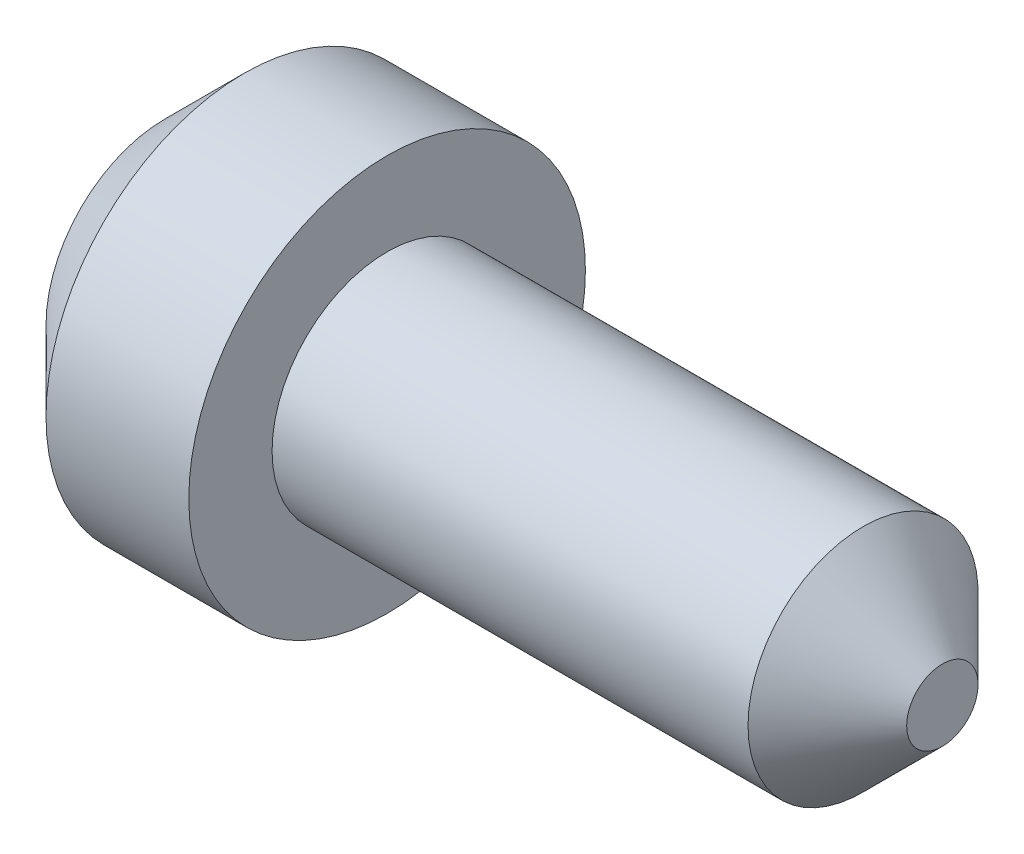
ISO-10303-21;
HEADER;
FILE_DESCRIPTION(('STEP AP214'),'2;1');
FILE_NAME('part.step','',(''),(''),'','','');
FILE_SCHEMA(('AUTOMOTIVE_DESIGN { 1 0 10303 214 1 1 1 1 }'));
ENDSEC;
DATA;
#1=APPLICATION_CONTEXT('core data for automotive mechanical design processes');
#2=APPLICATION_PROTOCOL_DEFINITION('international standard','automotive_design',2000,#1);
#3=PRODUCT_CONTEXT('',#1,'mechanical');
#4=PRODUCT('Part','Part','',(#3));
#5=PRODUCT_RELATED_PRODUCT_CATEGORY('part','',(#4));
#6=PRODUCT_DEFINITION_FORMATION('','',#4);
#7=PRODUCT_DEFINITION_CONTEXT('part definition',#1,'design');
#8=PRODUCT_DEFINITION('design','',#6,#7);
#9=PRODUCT_DEFINITION_SHAPE('','',#8);
#10=(LENGTH_UNIT() NAMED_UNIT(*) SI_UNIT(.MILLI.,.METRE.));
#11=(NAMED_UNIT(*) PLANE_ANGLE_UNIT() SI_UNIT($,.RADIAN.));
#12=(NAMED_UNIT(*) SI_UNIT($,.STERADIAN.) SOLID_ANGLE_UNIT());
#13=UNCERTAINTY_MEASURE_WITH_UNIT(LENGTH_MEASURE(1.E-05),#10,'distance_accuracy_value','');
#14=(GEOMETRIC_REPRESENTATION_CONTEXT(3) GLOBAL_UNCERTAINTY_ASSIGNED_CONTEXT((#13)) GLOBAL_UNIT_ASSIGNED_CONTEXT((#10,
#11,#12)) REPRESENTATION_CONTEXT('',''));
#15=CARTESIAN_POINT('',(0.,0.,0.));
#16=DIRECTION('',(0.,0.,1.));
#17=DIRECTION('',(1.,0.,0.));
#18=AXIS2_PLACEMENT_3D('',#15,#16,#17);
#19=CARTESIAN_POINT('',(0.,0.,0.));
#20=DIRECTION('',(1.,0.,0.));
#21=DIRECTION('',(0.,0.,-1.));
#22=AXIS2_PLACEMENT_3D('',#19,#20,#21);
#23=PLANE('',#22);
#24=CARTESIAN_POINT('',(0.,0.,0.));
#25=DIRECTION('',(1.,0.,0.));
#26=DIRECTION('',(0.,1.,0.));
#27=AXIS2_PLACEMENT_3D('',#24,#25,#26);
#28=CIRCLE('',#27,2.53999999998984);
#29=CARTESIAN_POINT('',(0.,2.53999999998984,0.));
#30=VERTEX_POINT('',#29);
#31=EDGE_CURVE('E18',#30,#30,#28,.T.);
#32=ORIENTED_EDGE('',*,*,#31,.F.);
#33=EDGE_LOOP('',(#32));
#34=FACE_BOUND('',#33,.T.);
#35=ADVANCED_FACE('F15',(#34),#23,.F.);
#36=CARTESIAN_POINT('',(1.69333333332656,0.,0.));
#37=DIRECTION('',(1.,0.,0.));
#38=DIRECTION('',(0.,1.,0.));
#39=AXIS2_PLACEMENT_3D('',#36,#37,#38);
#40=CONICAL_SURFACE('',#39,4.23333333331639,0.785398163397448);
#41=CARTESIAN_POINT('',(1.69333333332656,0.,0.));
#42=DIRECTION('',(1.,0.,0.));
#43=DIRECTION('',(0.,0.,-1.));
#44=AXIS2_PLACEMENT_3D('',#41,#42,#43);
#45=CIRCLE('',#44,4.2333333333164);
#46=CARTESIAN_POINT('',(1.69333333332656,0.,-4.2333333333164));
#47=VERTEX_POINT('',#46);
#48=EDGE_CURVE('E31',#47,#47,#45,.T.);
#49=ORIENTED_EDGE('',*,*,#48,.F.);
#50=EDGE_LOOP('',(#49));
#51=FACE_BOUND('',#50,.T.);
#52=ORIENTED_EDGE('',*,*,#31,.T.);
#53=EDGE_LOOP('',(#52));
#54=FACE_BOUND('',#53,.T.);
#55=ADVANCED_FACE('F43',(#51,#54),#40,.T.);
#56=CARTESIAN_POINT('',(16.5946666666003,0.,0.));
#57=DIRECTION('',(-1.,0.,0.));
#58=DIRECTION('',(0.,0.,1.));
#59=AXIS2_PLACEMENT_3D('',#56,#57,#58);
#60=PLANE('',#59);
#61=CARTESIAN_POINT('',(16.5946666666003,0.,0.));
#62=DIRECTION('',(-1.,0.,0.));
#63=DIRECTION('',(0.,0.,1.));
#64=AXIS2_PLACEMENT_3D('',#61,#62,#63);
#65=CIRCLE('',#64,0.761999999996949);
#66=CARTESIAN_POINT('',(16.5946666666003,0.,0.761999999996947));
#67=VERTEX_POINT('',#66);
#68=EDGE_CURVE('E33',#67,#67,#65,.T.);
#69=ORIENTED_EDGE('',*,*,#68,.F.);
#70=EDGE_LOOP('',(#69));
#71=FACE_BOUND('',#70,.T.);
#72=ADVANCED_FACE('F50',(#71),#60,.F.);
#73=CARTESIAN_POINT('',(0.,0.,0.));
#74=DIRECTION('',(1.,0.,0.));
#75=DIRECTION('',(0.,0.,-1.));
#76=AXIS2_PLACEMENT_3D('',#73,#74,#75);
#77=CYLINDRICAL_SURFACE('',#76,4.2333333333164);
#78=CARTESIAN_POINT('',(4.74133333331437,0.,0.));
#79=DIRECTION('',(1.,0.,0.));
#80=DIRECTION('',(0.,0.,-1.));
#81=AXIS2_PLACEMENT_3D('',#78,#79,#80);
#82=CIRCLE('',#81,4.2333333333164);
#83=CARTESIAN_POINT('',(4.74133333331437,0.,-4.2333333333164));
#84=VERTEX_POINT('',#83);
#85=EDGE_CURVE('E27',#84,#84,#82,.T.);
#86=ORIENTED_EDGE('',*,*,#85,.F.);
#87=EDGE_LOOP('',(#86));
#88=FACE_BOUND('',#87,.T.);
#89=ORIENTED_EDGE('',*,*,#48,.T.);
#90=EDGE_LOOP('',(#89));
#91=FACE_BOUND('',#90,.T.);
#92=ADVANCED_FACE('F66',(#88,#91),#77,.T.);
#93=CARTESIAN_POINT('',(14.9013333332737,0.,0.));
#94=DIRECTION('',(-1.,0.,0.));
#95=DIRECTION('',(0.,0.,1.));
#96=AXIS2_PLACEMENT_3D('',#93,#94,#95);
#97=CONICAL_SURFACE('',#96,2.45533333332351,0.785398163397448);
#98=CARTESIAN_POINT('',(14.9013333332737,0.,0.));
#99=DIRECTION('',(-1.,0.,0.));
#100=DIRECTION('',(0.,0.,1.));
#101=AXIS2_PLACEMENT_3D('',#98,#99,#100);
#102=CIRCLE('',#101,2.45533333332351);
#103=CARTESIAN_POINT('',(14.9013333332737,0.,2.45533333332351));
#104=VERTEX_POINT('',#103);
#105=EDGE_CURVE('E22',#104,#104,#102,.T.);
#106=CARTESIAN_POINT('',(16.5946666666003,0.,0.761999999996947));
#107=CARTESIAN_POINT('',(16.5770277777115,0.,0.779638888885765));
#108=CARTESIAN_POINT('',(16.5593888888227,0.,0.797277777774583));
#109=CARTESIAN_POINT('',(16.524111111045,0.,0.83255555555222));
#110=CARTESIAN_POINT('',(16.5064722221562,0.,0.850194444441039));
#111=CARTESIAN_POINT('',(16.4711944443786,0.,0.885472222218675));
#112=CARTESIAN_POINT('',(16.4535555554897,0.,0.903111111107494));
#113=CARTESIAN_POINT('',(16.4182777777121,0.,0.93838888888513));
#114=CARTESIAN_POINT('',(16.4006388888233,0.,0.956027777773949));
#115=CARTESIAN_POINT('',(16.3653611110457,0.,0.991305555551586));
#116=CARTESIAN_POINT('',(16.3477222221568,0.,1.0089444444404));
#117=CARTESIAN_POINT('',(16.3124444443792,0.,1.04422222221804));
#118=CARTESIAN_POINT('',(16.2948055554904,0.,1.06186111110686));
#119=CARTESIAN_POINT('',(16.2595277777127,0.,1.0971388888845));
#120=CARTESIAN_POINT('',(16.2418888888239,0.,1.11477777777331));
#121=CARTESIAN_POINT('',(16.2066111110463,0.,1.15005555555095));
#122=CARTESIAN_POINT('',(16.1889722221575,0.,1.16769444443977));
#123=CARTESIAN_POINT('',(16.1536944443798,0.,1.20297222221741));
#124=CARTESIAN_POINT('',(16.136055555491,0.,1.22061111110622));
#125=CARTESIAN_POINT('',(16.1007777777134,0.,1.25588888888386));
#126=CARTESIAN_POINT('',(16.0831388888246,0.,1.27352777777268));
#127=CARTESIAN_POINT('',(16.0478611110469,0.,1.30880555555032));
#128=CARTESIAN_POINT('',(16.0302222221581,0.,1.32644444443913));
#129=CARTESIAN_POINT('',(15.9949444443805,0.,1.36172222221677));
#130=CARTESIAN_POINT('',(15.9773055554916,0.,1.37936111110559));
#131=CARTESIAN_POINT('',(15.942027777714,0.,1.41463888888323));
#132=CARTESIAN_POINT('',(15.9243888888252,0.,1.43227777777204));
#133=CARTESIAN_POINT('',(15.8891111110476,0.,1.46755555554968));
#134=CARTESIAN_POINT('',(15.8714722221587,0.,1.4851944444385));
#135=CARTESIAN_POINT('',(15.8361944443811,0.,1.52047222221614));
#136=CARTESIAN_POINT('',(15.8185555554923,0.,1.53811111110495));
#137=CARTESIAN_POINT('',(15.7832777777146,0.,1.57338888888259));
#138=CARTESIAN_POINT('',(15.7656388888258,0.,1.59102777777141));
#139=CARTESIAN_POINT('',(15.7303611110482,0.,1.62630555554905));
#140=CARTESIAN_POINT('',(15.7127222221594,0.,1.64394444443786));
#141=CARTESIAN_POINT('',(15.6774444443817,0.,1.6792222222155));
#142=CARTESIAN_POINT('',(15.6598055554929,0.,1.69686111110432));
#143=CARTESIAN_POINT('',(15.6245277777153,0.,1.73213888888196));
#144=CARTESIAN_POINT('',(15.6068888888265,0.,1.74977777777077));
#145=CARTESIAN_POINT('',(15.5716111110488,0.,1.78505555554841));
#146=CARTESIAN_POINT('',(15.55397222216,0.,1.80269444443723));
#147=CARTESIAN_POINT('',(15.5186944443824,0.,1.83797222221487));
#148=CARTESIAN_POINT('',(15.5010555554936,0.,1.85561111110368));
#149=CARTESIAN_POINT('',(15.4657777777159,0.,1.89088888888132));
#150=CARTESIAN_POINT('',(15.4481388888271,0.,1.90852777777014));
#151=CARTESIAN_POINT('',(15.4128611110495,0.,1.94380555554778));
#152=CARTESIAN_POINT('',(15.3952222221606,0.,1.96144444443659));
#153=CARTESIAN_POINT('',(15.359944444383,0.,1.99672222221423));
#154=CARTESIAN_POINT('',(15.3423055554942,0.,2.01436111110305));
#155=CARTESIAN_POINT('',(15.3070277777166,0.,2.04963888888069));
#156=CARTESIAN_POINT('',(15.2893888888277,0.,2.0672777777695));
#157=CARTESIAN_POINT('',(15.2541111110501,0.,2.10255555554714));
#158=CARTESIAN_POINT('',(15.2364722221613,0.,2.12019444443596));
#159=CARTESIAN_POINT('',(15.2011944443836,0.,2.1554722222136));
#160=CARTESIAN_POINT('',(15.1835555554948,0.,2.17311111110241));
#161=CARTESIAN_POINT('',(15.1482777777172,0.,2.20838888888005));
#162=CARTESIAN_POINT('',(15.1306388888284,0.,2.22602777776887));
#163=CARTESIAN_POINT('',(15.0953611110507,0.,2.26130555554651));
#164=CARTESIAN_POINT('',(15.0777222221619,0.,2.27894444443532));
#165=CARTESIAN_POINT('',(15.0424444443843,0.,2.31422222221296));
#166=CARTESIAN_POINT('',(15.0248055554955,0.,2.33186111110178));
#167=CARTESIAN_POINT('',(14.9895277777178,0.,2.36713888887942));
#168=CARTESIAN_POINT('',(14.971888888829,0.,2.38477777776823));
#169=CARTESIAN_POINT('',(14.9366111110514,0.,2.42005555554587));
#170=CARTESIAN_POINT('',(14.9189722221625,0.,2.43769444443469));
#171=CARTESIAN_POINT('',(14.9013333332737,0.,2.45533333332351));
#172=B_SPLINE_CURVE_WITH_KNOTS('',3,(#106,#107,#108,#109,#110,#111,#112,#113,#114,#115,#116,
#117,#118,#119,#120,#121,#122,#123,#124,#125,#126,#127,#128,#129,#130,#131,#132,#133,#134,#135,
#136,#137,#138,#139,#140,#141,#142,#143,#144,#145,#146,#147,#148,#149,#150,#151,#152,#153,#154,
#155,#156,#157,#158,#159,#160,#161,#162,#163,#164,#165,#166,#167,#168,#169,#170,#171),
.UNSPECIFIED.,.F.,.F.,(4,2,2,2,2,2,2,2,2,2,2,2,2,2,2,2,2,2,2,2,2,2,2,2,2,2,2,2,2,2,2,2,4),(0.,
0.0748354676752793,0.149670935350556,0.224506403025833,0.29934187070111,0.374177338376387,
0.449012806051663,0.52384827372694,0.598683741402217,0.673519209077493,0.74835467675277,
0.823190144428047,0.898025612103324,0.9728610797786,1.04769654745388,1.12253201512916,
1.19736748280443,1.27220295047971,1.34703841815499,1.42187388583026,1.49670935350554,
1.57154482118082,1.64638028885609,1.72121575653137,1.79605122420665,1.87088669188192,
1.9457221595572,2.02055762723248,2.09539309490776,2.17022856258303,2.24506403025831,
2.31989949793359,2.39473496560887),.UNSPECIFIED.);
#173=EDGE_CURVE('BSEAM60',#67,#104,#172,.T.);
#174=ORIENTED_EDGE('',*,*,#68,.T.);
#175=ORIENTED_EDGE('',*,*,#105,.F.);
#176=ORIENTED_EDGE('',*,*,#173,.T.);
#177=ORIENTED_EDGE('',*,*,#173,.F.);
#178=EDGE_LOOP('',(#174,#176,#175,#177));
#179=FACE_BOUND('',#178,.T.);
#180=ADVANCED_FACE('F60',(#179),#97,.T.);
#181=CARTESIAN_POINT('',(4.74133333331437,0.,0.));
#182=DIRECTION('',(1.,0.,0.));
#183=DIRECTION('',(0.,0.,-1.));
#184=AXIS2_PLACEMENT_3D('',#181,#182,#183);
#185=PLANE('',#184);
#186=CARTESIAN_POINT('',(4.74133333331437,0.,0.));
#187=DIRECTION('',(-1.,0.,0.));
#188=DIRECTION('',(0.,0.,1.));
#189=AXIS2_PLACEMENT_3D('',#186,#187,#188);
#190=CIRCLE('',#189,2.45533333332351);
#191=CARTESIAN_POINT('',(4.74133333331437,0.,2.45533333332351));
#192=VERTEX_POINT('',#191);
#193=EDGE_CURVE('E10',#192,#192,#190,.F.);
#194=ORIENTED_EDGE('',*,*,#193,.F.);
#195=EDGE_LOOP('',(#194));
#196=FACE_BOUND('',#195,.T.);
#197=ORIENTED_EDGE('',*,*,#85,.T.);
#198=EDGE_LOOP('',(#197));
#199=FACE_BOUND('',#198,.T.);
#200=ADVANCED_FACE('F54',(#196,#199),#185,.T.);
#201=CARTESIAN_POINT('',(17.1873333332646,0.,0.));
#202=DIRECTION('',(-1.,0.,0.));
#203=DIRECTION('',(0.,0.,1.));
#204=AXIS2_PLACEMENT_3D('',#201,#202,#203);
#205=CYLINDRICAL_SURFACE('',#204,2.45533333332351);
#206=ORIENTED_EDGE('',*,*,#105,.T.);
#207=EDGE_LOOP('',(#206));
#208=FACE_BOUND('',#207,.T.);
#209=ORIENTED_EDGE('',*,*,#193,.T.);
#210=EDGE_LOOP('',(#209));
#211=FACE_BOUND('',#210,.T.);
#212=ADVANCED_FACE('F52',(#208,#211),#205,.T.);
#213=CLOSED_SHELL('',(#35,#55,#72,#92,#180,#200,#212));
#214=MANIFOLD_SOLID_BREP('B1',#213);
#215=ADVANCED_BREP_SHAPE_REPRESENTATION('',(#18,#214),#14);
#216=SHAPE_DEFINITION_REPRESENTATION(#9,#215);
ENDSEC;
END-ISO-10303-21;
